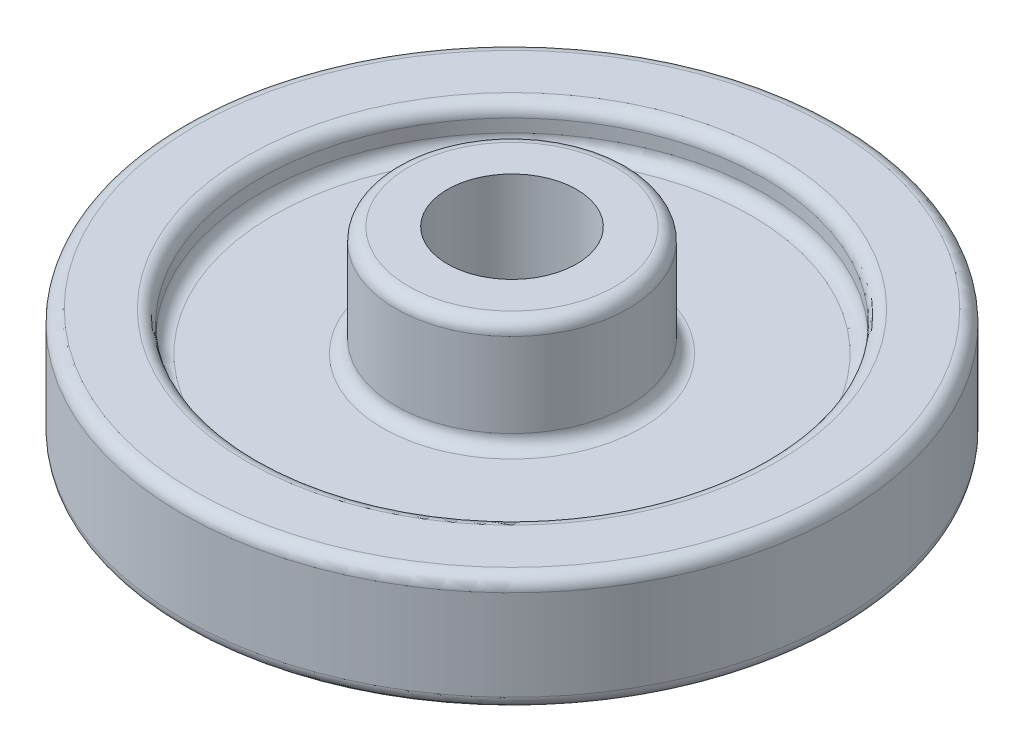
from build123d import *


with BuildPart() as part:
    # Sketch1 → Base-Revolve (revolve)
    with BuildSketch(Plane.XY, mode=Mode.PRIVATE) as base_revolve_sk:
        with BuildLine():
            Line((15.875, 0), (15.875, 46.0502))
            Line((15.875, 46.0502), (25.4, 46.0502))
            ThreePointArc((25.4, 46.0502), (27.64506403, 45.12026403), (28.575, 42.8752))
            Line((28.575, 42.8752), (28.575, 22.225))
            ThreePointArc((28.575, 22.225), (29.50493597, 19.97993597), (31.75, 19.05))
            Line((31.75, 19.05), (58.7375, 19.05))
            ThreePointArc((58.7375, 19.05), (60.98256403, 19.97993597), (61.9125, 22.225))
            Line((61.9125, 22.225), (61.9125, 25.4))
            ThreePointArc((61.9125, 25.4), (62.84243597, 27.64506403), (65.0875, 28.575))
            Line((65.0875, 28.575), (77.7875, 28.575))
            ThreePointArc((77.7875, 28.575), (80.03256403, 27.64506403), (80.9625, 25.4))
            Line((80.9625, 25.4), (80.9625, 3.175))
            ThreePointArc((80.9625, 3.175), (80.03256403, 0.92993597), (77.7875, 0))
            Line((77.7875, 0), (65.0875, 0))
            ThreePointArc((65.0875, 0), (62.84243597, 0.92993597), (61.9125, 3.175))
            Line((61.9125, 3.175), (61.9125, 6.35))
            ThreePointArc((61.9125, 6.35), (60.98256403, 8.59506403), (58.7375, 9.525))
            Line((58.7375, 9.525), (31.75, 9.525))
            ThreePointArc((31.75, 9.525), (29.50493597, 8.59506403), (28.575, 6.35))
            Line((28.575, 6.35), (28.575, 0))
            Line((28.575, 0), (15.875, 0))
        make_face()
    revolve(base_revolve_sk.sketch.rotate(Axis((0, 0, 0), (0, 1, 0)), 90), axis=Axis((0, 0, 0), (0, 1, 0)))


solid = part.part
